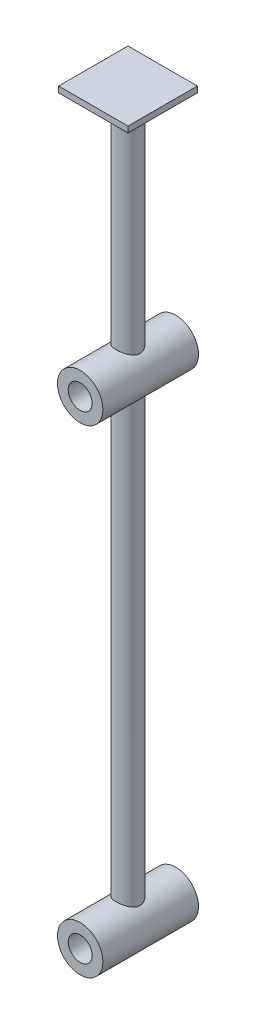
from build123d import *

# Parameters (mm, degrees)
EXTRUSION1_DEPTH        = 40
EXTRUSION1_DEPTH_BACK   = 40
ESQUISSE1_R             = 19
ESQUISSE1_R_2           = 10
ESQUISSE2_R             = 10
EXTRUSION2_DEPTH        = 600
ESQUISSE3_W             = 58
ESQUISSE3_H             = 58
EXTRUSION3_DEPTH        = 5
ESQUISSE4_R             = 19
EXTRUSION4_DEPTH        = 80
ESQUISSE5_R             = 10
ENL_V_MAT_EXTRU_1_DEPTH = 611.954990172


with BuildPart() as part:
    # Esquisse1 → Extrusion1 (new, two sides: drawn at the far end of the back side and taken through both)
    with BuildSketch(Plane.XY.offset(-EXTRUSION1_DEPTH_BACK)):
        Circle(ESQUISSE1_R)
        Circle(ESQUISSE1_R_2, mode=Mode.SUBTRACT)
    extrude(amount=EXTRUSION1_DEPTH + EXTRUSION1_DEPTH_BACK)

    # Esquisse2 → Extrusion2 (add)
    with BuildSketch(Plane(origin=(0, 0, 0), x_dir=(1, 0, 0), z_dir=(0, 1, 0))):
        with Locations(Location((0, 0, 0), (0, 0, 90))):
            Circle(ESQUISSE2_R)
    extrude(amount=EXTRUSION2_DEPTH)

    # Esquisse3 → Extrusion3 (add)
    with BuildSketch(Plane(origin=(0, 600, 0), x_dir=(-1, 0, 0), z_dir=(0, 1, 0))):
        Rectangle(ESQUISSE3_W, ESQUISSE3_H)
    extrude(amount=EXTRUSION3_DEPTH)

    # Esquisse4 → Extrusion4 (add)
    with BuildSketch(Plane.XY.offset(40)):
        with Locations((0, 400)):
            Circle(ESQUISSE4_R)
    extrude(amount=-EXTRUSION4_DEPTH)

    # Esquisse5 → Enl_v. mat.-Extru.1 (cut, through all)
    with BuildSketch(Plane.XY.offset(40)):
        with Locations((0, 400)):
            Circle(ESQUISSE5_R)
    extrude(amount=-ENL_V_MAT_EXTRU_1_DEPTH, mode=Mode.SUBTRACT)


solid = part.part
